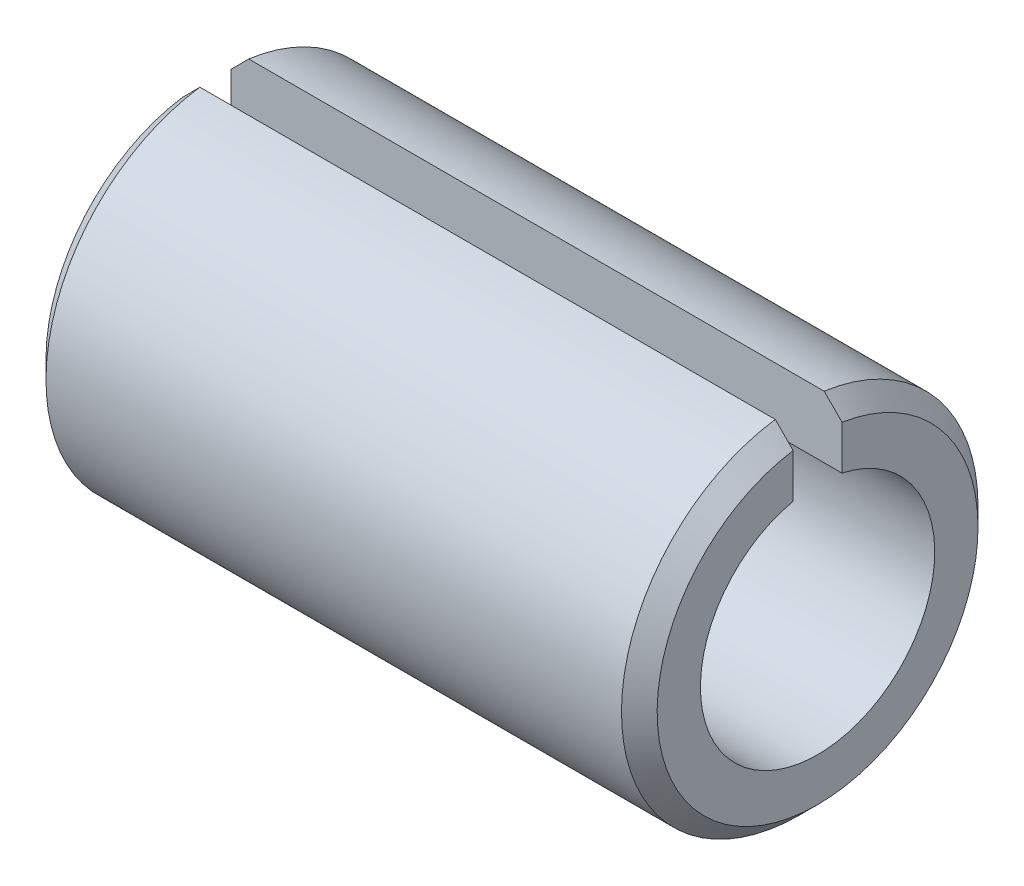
from build123d import *

# Parameters (mm, degrees)
ENL_V_MAT_EXTRU_2_DEPTH = 7.490377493


with BuildPart() as part:
    # Esquisse1 → Base-R_volution (revolve)
    with BuildSketch(Plane.XY, mode=Mode.PRIVATE) as base_r_volution_sk:
        Polygon((0, 1.15), (0, 1.575), (0.175, 1.75), (5.825, 1.75), (6, 1.575), (6, 1.15), align=None)
    revolve(base_r_volution_sk.sketch.rotate(Axis((0, 0, 0), (1, 0, 0)), 90), axis=Axis((0, 0, 0), (1, 0, 0)))

    # Esquisse2 → Enl_v. mat.-Extru.2 (cut, through all)
    with BuildSketch(Plane(origin=(0, 0, 0), x_dir=(0, 0, -1), z_dir=(1, 0, 0))):
        with BuildLine():
            Line((0.24, 1.733464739), (0.24, 1.124677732))
            ThreePointArc((0.24, 1.124677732), (0, 1.15), (-0.24, 1.124677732))
            Line((-0.24, 1.124677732), (-0.24, 1.733464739))
            ThreePointArc((-0.24, 1.733464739), (0, 1.75), (0.24, 1.733464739))
        make_face()
    extrude(amount=ENL_V_MAT_EXTRU_2_DEPTH, mode=Mode.SUBTRACT)


solid = part.part
